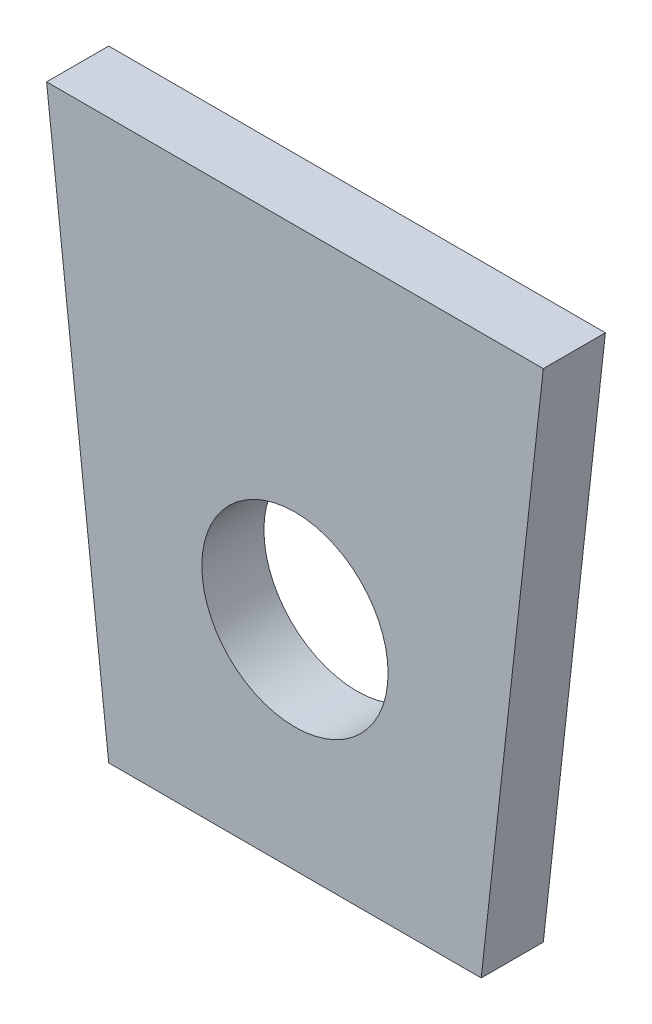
ISO-10303-21;
HEADER;
FILE_DESCRIPTION(('STEP AP214'),'2;1');
FILE_NAME('part.step','',(''),(''),'','','');
FILE_SCHEMA(('AUTOMOTIVE_DESIGN { 1 0 10303 214 1 1 1 1 }'));
ENDSEC;
DATA;
#1=APPLICATION_CONTEXT('core data for automotive mechanical design processes');
#2=APPLICATION_PROTOCOL_DEFINITION('international standard','automotive_design',2000,#1);
#3=PRODUCT_CONTEXT('',#1,'mechanical');
#4=PRODUCT('Part','Part','',(#3));
#5=PRODUCT_RELATED_PRODUCT_CATEGORY('part','',(#4));
#6=PRODUCT_DEFINITION_FORMATION('','',#4);
#7=PRODUCT_DEFINITION_CONTEXT('part definition',#1,'design');
#8=PRODUCT_DEFINITION('design','',#6,#7);
#9=PRODUCT_DEFINITION_SHAPE('','',#8);
#10=(LENGTH_UNIT() NAMED_UNIT(*) SI_UNIT(.MILLI.,.METRE.));
#11=(NAMED_UNIT(*) PLANE_ANGLE_UNIT() SI_UNIT($,.RADIAN.));
#12=(NAMED_UNIT(*) SI_UNIT($,.STERADIAN.) SOLID_ANGLE_UNIT());
#13=UNCERTAINTY_MEASURE_WITH_UNIT(LENGTH_MEASURE(1.E-05),#10,'distance_accuracy_value','');
#14=(GEOMETRIC_REPRESENTATION_CONTEXT(3) GLOBAL_UNCERTAINTY_ASSIGNED_CONTEXT((#13)) GLOBAL_UNIT_ASSIGNED_CONTEXT((#10,
#11,#12)) REPRESENTATION_CONTEXT('',''));
#15=CARTESIAN_POINT('',(0.,0.,0.));
#16=DIRECTION('',(0.,0.,1.));
#17=DIRECTION('',(1.,0.,0.));
#18=AXIS2_PLACEMENT_3D('',#15,#16,#17);
#19=CARTESIAN_POINT('',(-40.,0.,10.));
#20=DIRECTION('',(0.,0.,-1.));
#21=DIRECTION('',(-1.,0.,0.));
#22=AXIS2_PLACEMENT_3D('',#19,#20,#21);
#23=PLANE('',#22);
#24=DIRECTION('',(0.110431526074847,-0.993883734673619,0.));
#25=VECTOR('',#24,1.);
#26=CARTESIAN_POINT('',(-30.,-90.,10.));
#27=LINE('',#26,#25);
#28=CARTESIAN_POINT('',(-40.,0.,10.));
#29=VERTEX_POINT('',#28);
#30=CARTESIAN_POINT('',(-30.,-90.,10.));
#31=VERTEX_POINT('',#30);
#32=EDGE_CURVE('E110',#29,#31,#27,.T.);
#33=ORIENTED_EDGE('',*,*,#32,.T.);
#34=DIRECTION('',(1.,0.,0.));
#35=VECTOR('',#34,1.);
#36=CARTESIAN_POINT('',(30.,-90.,10.));
#37=LINE('',#36,#35);
#38=CARTESIAN_POINT('',(30.,-90.,10.));
#39=VERTEX_POINT('',#38);
#40=EDGE_CURVE('E95',#31,#39,#37,.T.);
#41=ORIENTED_EDGE('',*,*,#40,.T.);
#42=DIRECTION('',(0.110431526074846,0.993883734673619,0.));
#43=VECTOR('',#42,1.);
#44=CARTESIAN_POINT('',(40.,0.,10.));
#45=LINE('',#44,#43);
#46=CARTESIAN_POINT('',(40.,0.,10.));
#47=VERTEX_POINT('',#46);
#48=EDGE_CURVE('E61',#39,#47,#45,.T.);
#49=ORIENTED_EDGE('',*,*,#48,.T.);
#50=DIRECTION('',(-1.,0.,0.));
#51=VECTOR('',#50,1.);
#52=CARTESIAN_POINT('',(-40.,0.,10.));
#53=LINE('',#52,#51);
#54=EDGE_CURVE('E56',#47,#29,#53,.T.);
#55=ORIENTED_EDGE('',*,*,#54,.T.);
#56=EDGE_LOOP('',(#33,#41,#49,#55));
#57=FACE_BOUND('',#56,.T.);
#58=CARTESIAN_POINT('',(0.,-55.,10.));
#59=DIRECTION('',(0.,0.,1.));
#60=DIRECTION('',(1.,0.,0.));
#61=AXIS2_PLACEMENT_3D('',#58,#59,#60);
#62=CIRCLE('',#61,15.);
#63=CARTESIAN_POINT('',(15.,-55.,10.));
#64=VERTEX_POINT('',#63);
#65=EDGE_CURVE('E100',#64,#64,#62,.T.);
#66=ORIENTED_EDGE('',*,*,#65,.F.);
#67=EDGE_LOOP('',(#66));
#68=FACE_BOUND('',#67,.T.);
#69=ADVANCED_FACE('F41',(#57,#68),#23,.F.);
#70=CARTESIAN_POINT('',(-40.,0.,0.));
#71=DIRECTION('',(0.,0.,-1.));
#72=DIRECTION('',(-1.,0.,0.));
#73=AXIS2_PLACEMENT_3D('',#70,#71,#72);
#74=PLANE('',#73);
#75=DIRECTION('',(0.110431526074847,-0.993883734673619,0.));
#76=VECTOR('',#75,1.);
#77=CARTESIAN_POINT('',(-30.,-90.,0.));
#78=LINE('',#77,#76);
#79=CARTESIAN_POINT('',(-40.,0.,0.));
#80=VERTEX_POINT('',#79);
#81=CARTESIAN_POINT('',(-30.,-90.,0.));
#82=VERTEX_POINT('',#81);
#83=EDGE_CURVE('E87',#80,#82,#78,.T.);
#84=ORIENTED_EDGE('',*,*,#83,.F.);
#85=DIRECTION('',(-1.,0.,0.));
#86=VECTOR('',#85,1.);
#87=CARTESIAN_POINT('',(-40.,0.,0.));
#88=LINE('',#87,#86);
#89=CARTESIAN_POINT('',(40.,0.,0.));
#90=VERTEX_POINT('',#89);
#91=EDGE_CURVE('E108',#90,#80,#88,.T.);
#92=ORIENTED_EDGE('',*,*,#91,.F.);
#93=DIRECTION('',(0.110431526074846,0.993883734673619,0.));
#94=VECTOR('',#93,1.);
#95=CARTESIAN_POINT('',(40.,0.,0.));
#96=LINE('',#95,#94);
#97=CARTESIAN_POINT('',(30.,-90.,0.));
#98=VERTEX_POINT('',#97);
#99=EDGE_CURVE('E88',#98,#90,#96,.T.);
#100=ORIENTED_EDGE('',*,*,#99,.F.);
#101=DIRECTION('',(1.,0.,0.));
#102=VECTOR('',#101,1.);
#103=CARTESIAN_POINT('',(30.,-90.,0.));
#104=LINE('',#103,#102);
#105=EDGE_CURVE('E82',#82,#98,#104,.T.);
#106=ORIENTED_EDGE('',*,*,#105,.F.);
#107=EDGE_LOOP('',(#84,#92,#100,#106));
#108=FACE_BOUND('',#107,.T.);
#109=CARTESIAN_POINT('',(0.,-55.,0.));
#110=DIRECTION('',(0.,0.,1.));
#111=DIRECTION('',(1.,0.,0.));
#112=AXIS2_PLACEMENT_3D('',#109,#110,#111);
#113=CIRCLE('',#112,15.);
#114=CARTESIAN_POINT('',(15.,-55.,0.));
#115=VERTEX_POINT('',#114);
#116=EDGE_CURVE('E103',#115,#115,#113,.T.);
#117=ORIENTED_EDGE('',*,*,#116,.T.);
#118=EDGE_LOOP('',(#117));
#119=FACE_BOUND('',#118,.T.);
#120=ADVANCED_FACE('F83',(#108,#119),#74,.T.);
#121=CARTESIAN_POINT('',(-30.,-90.,10.));
#122=DIRECTION('',(0.993883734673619,0.110431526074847,0.));
#123=DIRECTION('',(-0.110431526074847,0.993883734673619,0.));
#124=AXIS2_PLACEMENT_3D('',#121,#122,#123);
#125=PLANE('',#124);
#126=ORIENTED_EDGE('',*,*,#83,.T.);
#127=DIRECTION('',(0.,0.,-1.));
#128=VECTOR('',#127,1.);
#129=CARTESIAN_POINT('',(-30.,-90.,10.));
#130=LINE('',#129,#128);
#131=EDGE_CURVE('E11',#31,#82,#130,.T.);
#132=ORIENTED_EDGE('',*,*,#131,.F.);
#133=ORIENTED_EDGE('',*,*,#32,.F.);
#134=DIRECTION('',(0.,0.,-1.));
#135=VECTOR('',#134,1.);
#136=CARTESIAN_POINT('',(-40.,0.,10.));
#137=LINE('',#136,#135);
#138=EDGE_CURVE('E99',#29,#80,#137,.T.);
#139=ORIENTED_EDGE('',*,*,#138,.T.);
#140=EDGE_LOOP('',(#126,#132,#133,#139));
#141=FACE_BOUND('',#140,.T.);
#142=ADVANCED_FACE('F43',(#141),#125,.F.);
#143=CARTESIAN_POINT('',(30.,-90.,10.));
#144=DIRECTION('',(0.,1.,0.));
#145=DIRECTION('',(0.,0.,1.));
#146=AXIS2_PLACEMENT_3D('',#143,#144,#145);
#147=PLANE('',#146);
#148=ORIENTED_EDGE('',*,*,#105,.T.);
#149=DIRECTION('',(0.,0.,-1.));
#150=VECTOR('',#149,1.);
#151=CARTESIAN_POINT('',(30.,-90.,10.));
#152=LINE('',#151,#150);
#153=EDGE_CURVE('E49',#39,#98,#152,.T.);
#154=ORIENTED_EDGE('',*,*,#153,.F.);
#155=ORIENTED_EDGE('',*,*,#40,.F.);
#156=ORIENTED_EDGE('',*,*,#131,.T.);
#157=EDGE_LOOP('',(#148,#154,#155,#156));
#158=FACE_BOUND('',#157,.T.);
#159=ADVANCED_FACE('F94',(#158),#147,.F.);
#160=CARTESIAN_POINT('',(40.,0.,10.));
#161=DIRECTION('',(-0.993883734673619,0.110431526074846,0.));
#162=DIRECTION('',(-0.110431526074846,-0.993883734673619,0.));
#163=AXIS2_PLACEMENT_3D('',#160,#161,#162);
#164=PLANE('',#163);
#165=ORIENTED_EDGE('',*,*,#99,.T.);
#166=DIRECTION('',(0.,0.,-1.));
#167=VECTOR('',#166,1.);
#168=CARTESIAN_POINT('',(40.,0.,10.));
#169=LINE('',#168,#167);
#170=EDGE_CURVE('E116',#47,#90,#169,.T.);
#171=ORIENTED_EDGE('',*,*,#170,.F.);
#172=ORIENTED_EDGE('',*,*,#48,.F.);
#173=ORIENTED_EDGE('',*,*,#153,.T.);
#174=EDGE_LOOP('',(#165,#171,#172,#173));
#175=FACE_BOUND('',#174,.T.);
#176=ADVANCED_FACE('F119',(#175),#164,.F.);
#177=CARTESIAN_POINT('',(-40.,0.,10.));
#178=DIRECTION('',(0.,-1.,0.));
#179=DIRECTION('',(0.,0.,-1.));
#180=AXIS2_PLACEMENT_3D('',#177,#178,#179);
#181=PLANE('',#180);
#182=ORIENTED_EDGE('',*,*,#91,.T.);
#183=ORIENTED_EDGE('',*,*,#138,.F.);
#184=ORIENTED_EDGE('',*,*,#54,.F.);
#185=ORIENTED_EDGE('',*,*,#170,.T.);
#186=EDGE_LOOP('',(#182,#183,#184,#185));
#187=FACE_BOUND('',#186,.T.);
#188=ADVANCED_FACE('F121',(#187),#181,.F.);
#189=CARTESIAN_POINT('',(0.,-55.,10.));
#190=DIRECTION('',(0.,0.,-1.));
#191=DIRECTION('',(-1.,0.,0.));
#192=AXIS2_PLACEMENT_3D('',#189,#190,#191);
#193=CYLINDRICAL_SURFACE('',#192,15.);
#194=ORIENTED_EDGE('',*,*,#65,.T.);
#195=EDGE_LOOP('',(#194));
#196=FACE_BOUND('',#195,.T.);
#197=ORIENTED_EDGE('',*,*,#116,.F.);
#198=EDGE_LOOP('',(#197));
#199=FACE_BOUND('',#198,.T.);
#200=ADVANCED_FACE('F127',(#196,#199),#193,.F.);
#201=CLOSED_SHELL('',(#69,#120,#142,#159,#176,#188,#200));
#202=MANIFOLD_SOLID_BREP('B2',#201);
#203=ADVANCED_BREP_SHAPE_REPRESENTATION('',(#18,#202),#14);
#204=SHAPE_DEFINITION_REPRESENTATION(#9,#203);
ENDSEC;
END-ISO-10303-21;
